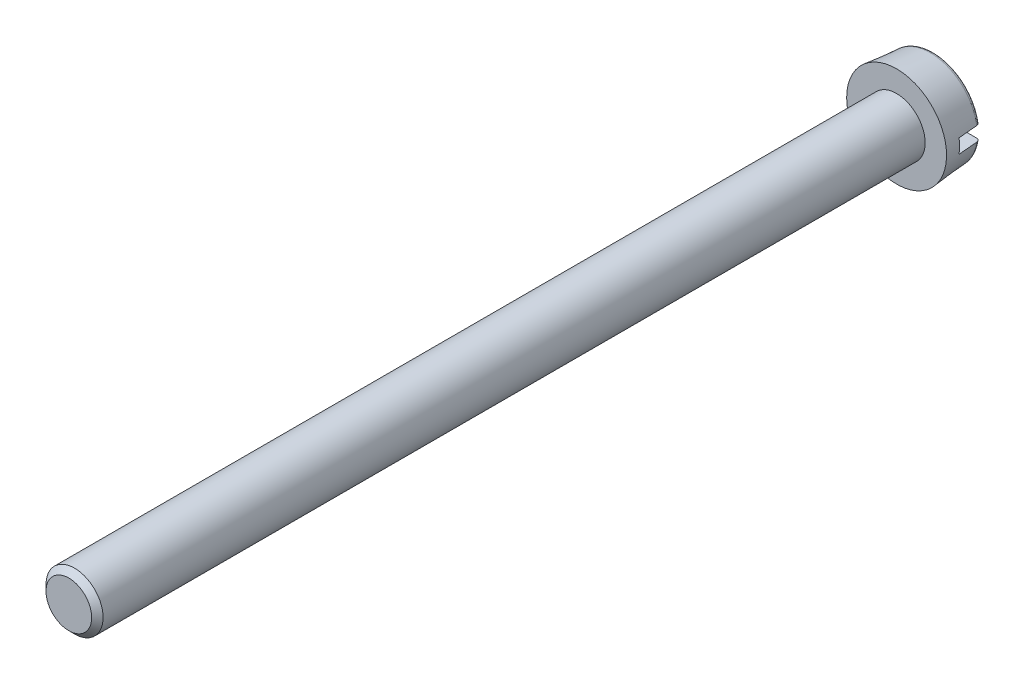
ISO-10303-21;
HEADER;
FILE_DESCRIPTION(('STEP AP214'),'2;1');
FILE_NAME('part.step','',(''),(''),'','','');
FILE_SCHEMA(('AUTOMOTIVE_DESIGN { 1 0 10303 214 1 1 1 1 }'));
ENDSEC;
DATA;
#1=APPLICATION_CONTEXT('core data for automotive mechanical design processes');
#2=APPLICATION_PROTOCOL_DEFINITION('international standard','automotive_design',2000,#1);
#3=PRODUCT_CONTEXT('',#1,'mechanical');
#4=PRODUCT('Part','Part','',(#3));
#5=PRODUCT_RELATED_PRODUCT_CATEGORY('part','',(#4));
#6=PRODUCT_DEFINITION_FORMATION('','',#4);
#7=PRODUCT_DEFINITION_CONTEXT('part definition',#1,'design');
#8=PRODUCT_DEFINITION('design','',#6,#7);
#9=PRODUCT_DEFINITION_SHAPE('','',#8);
#10=(LENGTH_UNIT() NAMED_UNIT(*) SI_UNIT(.MILLI.,.METRE.));
#11=(NAMED_UNIT(*) PLANE_ANGLE_UNIT() SI_UNIT($,.RADIAN.));
#12=(NAMED_UNIT(*) SI_UNIT($,.STERADIAN.) SOLID_ANGLE_UNIT());
#13=UNCERTAINTY_MEASURE_WITH_UNIT(LENGTH_MEASURE(1.E-05),#10,'distance_accuracy_value','');
#14=(GEOMETRIC_REPRESENTATION_CONTEXT(3) GLOBAL_UNCERTAINTY_ASSIGNED_CONTEXT((#13)) GLOBAL_UNIT_ASSIGNED_CONTEXT((#10,
#11,#12)) REPRESENTATION_CONTEXT('',''));
#15=CARTESIAN_POINT('',(0.,0.,0.));
#16=DIRECTION('',(0.,0.,1.));
#17=DIRECTION('',(1.,0.,0.));
#18=AXIS2_PLACEMENT_3D('',#15,#16,#17);
#19=CARTESIAN_POINT('',(0.,0.,-2.6));
#20=DIRECTION('',(0.,0.,1.));
#21=DIRECTION('',(1.,0.,0.));
#22=AXIS2_PLACEMENT_3D('',#19,#20,#21);
#23=PLANE('',#22);
#24=DIRECTION('',(-1.,0.,0.));
#25=VECTOR('',#24,1.);
#26=CARTESIAN_POINT('',(-3.5,0.5,-2.6));
#27=LINE('',#26,#25);
#28=CARTESIAN_POINT('',(2.99280396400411,0.5,-2.6));
#29=VERTEX_POINT('',#28);
#30=CARTESIAN_POINT('',(-2.99280396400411,0.5,-2.6));
#31=VERTEX_POINT('',#30);
#32=EDGE_CURVE('E94',#29,#31,#27,.T.);
#33=ORIENTED_EDGE('',*,*,#32,.T.);
#34=CARTESIAN_POINT('',(0.,0.,-2.6));
#35=DIRECTION('',(0.,0.,-1.));
#36=DIRECTION('',(-1.,0.,0.));
#37=AXIS2_PLACEMENT_3D('',#34,#35,#36);
#38=CIRCLE('',#37,3.03428336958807);
#39=EDGE_CURVE('E105',#31,#29,#38,.T.);
#40=ORIENTED_EDGE('',*,*,#39,.T.);
#41=EDGE_LOOP('',(#33,#40));
#42=FACE_BOUND('',#41,.T.);
#43=ADVANCED_FACE('F29',(#42),#23,.F.);
#44=DIRECTION('',(1.,0.,0.));
#45=VECTOR('',#44,1.);
#46=CARTESIAN_POINT('',(-3.5,-0.5,-2.6));
#47=LINE('',#46,#45);
#48=CARTESIAN_POINT('',(-2.99280396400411,-0.5,-2.6));
#49=VERTEX_POINT('',#48);
#50=CARTESIAN_POINT('',(2.99280396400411,-0.5,-2.6));
#51=VERTEX_POINT('',#50);
#52=EDGE_CURVE('E177',#49,#51,#47,.T.);
#53=ORIENTED_EDGE('',*,*,#52,.T.);
#54=EDGE_CURVE('E108',#51,#49,#38,.T.);
#55=ORIENTED_EDGE('',*,*,#54,.T.);
#56=EDGE_LOOP('',(#53,#55));
#57=FACE_BOUND('',#56,.T.);
#58=ADVANCED_FACE('F170',(#57),#23,.F.);
#59=CARTESIAN_POINT('',(0.,0.,-2.34));
#60=DIRECTION('',(0.,0.,-1.));
#61=DIRECTION('',(-1.,0.,0.));
#62=AXIS2_PLACEMENT_3D('',#59,#60,#61);
#63=TOROIDAL_SURFACE('',#62,3.03428336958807,0.26);
#64=CARTESIAN_POINT('',(-3.20593369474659,-0.5,-2.49273899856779));
#65=CARTESIAN_POINT('',(-3.21452220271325,-0.5,-2.48104813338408));
#66=CARTESIAN_POINT('',(-3.22213584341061,-0.5,-2.4686288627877));
#67=CARTESIAN_POINT('',(-3.23517931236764,-0.5,-2.44267992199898));
#68=CARTESIAN_POINT('',(-3.24060678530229,-0.5,-2.42914907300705));
#69=CARTESIAN_POINT('',(-3.2491065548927,-0.5,-2.40136759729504));
#70=CARTESIAN_POINT('',(-3.25217924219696,-0.5,-2.38711709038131));
#71=CARTESIAN_POINT('',(-3.25587593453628,-0.5,-2.35830538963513));
#72=CARTESIAN_POINT('',(-3.25650051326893,-0.5,-2.34374426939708));
#73=CARTESIAN_POINT('',(-3.25528642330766,-0.5,-2.31478610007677));
#74=CARTESIAN_POINT('',(-3.25345800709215,-0.5,-2.30038862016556));
#75=CARTESIAN_POINT('',(-3.24741106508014,-0.5,-2.27210454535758));
#76=CARTESIAN_POINT('',(-3.24319247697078,-0.5,-2.25821796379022));
#77=CARTESIAN_POINT('',(-3.23248845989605,-0.5,-2.23133883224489));
#78=CARTESIAN_POINT('',(-3.22600169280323,-0.5,-2.21834681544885));
#79=CARTESIAN_POINT('',(-3.21095392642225,-0.5,-2.1936258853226));
#80=CARTESIAN_POINT('',(-3.20239287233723,-0.5,-2.18189700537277));
#81=CARTESIAN_POINT('',(-3.1833771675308,-0.5,-2.1599421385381));
#82=CARTESIAN_POINT('',(-3.17290934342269,-0.5,-2.14972756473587));
#83=CARTESIAN_POINT('',(-3.15042433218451,-0.5,-2.13117694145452));
#84=CARTESIAN_POINT('',(-3.13840706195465,-0.5,-2.12284099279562));
#85=CARTESIAN_POINT('',(-3.11301845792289,-0.5,-2.10818216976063));
#86=CARTESIAN_POINT('',(-3.09963325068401,-0.5,-2.10188332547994));
#87=CARTESIAN_POINT('',(-3.07200360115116,-0.5,-2.09159292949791));
#88=CARTESIAN_POINT('',(-3.05775910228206,-0.5,-2.08760152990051));
#89=CARTESIAN_POINT('',(-3.02863847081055,-0.5,-2.08199385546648));
#90=CARTESIAN_POINT('',(-3.01375693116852,-0.5,-2.0804056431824));
#91=CARTESIAN_POINT('',(-2.98393701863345,-0.5,-2.07973102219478));
#92=CARTESIAN_POINT('',(-2.96899864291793,-0.5,-2.08064473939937));
#93=CARTESIAN_POINT('',(-2.93937852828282,-0.5,-2.08496295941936));
#94=CARTESIAN_POINT('',(-2.92469933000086,-0.5,-2.08838491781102));
#95=CARTESIAN_POINT('',(-2.89612444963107,-0.5,-2.09764767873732));
#96=CARTESIAN_POINT('',(-2.88222877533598,-0.5,-2.10348850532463));
#97=CARTESIAN_POINT('',(-2.85564093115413,-0.5,-2.11742304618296));
#98=CARTESIAN_POINT('',(-2.84294711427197,-0.5,-2.12551361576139));
#99=CARTESIAN_POINT('',(-2.81911627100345,-0.5,-2.14373207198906));
#100=CARTESIAN_POINT('',(-2.80797917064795,-0.5,-2.15385986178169));
#101=CARTESIAN_POINT('',(-2.78770744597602,-0.5,-2.175756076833));
#102=CARTESIAN_POINT('',(-2.77855308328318,-0.5,-2.18750622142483));
#103=CARTESIAN_POINT('',(-2.76238342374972,-0.5,-2.21239644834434));
#104=CARTESIAN_POINT('',(-2.75536793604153,-0.5,-2.22553640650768));
#105=CARTESIAN_POINT('',(-2.74378882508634,-0.5,-2.25261692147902));
#106=CARTESIAN_POINT('',(-2.73918923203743,-0.5,-2.26654210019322));
#107=CARTESIAN_POINT('',(-2.73242630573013,-0.5,-2.29497183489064));
#108=CARTESIAN_POINT('',(-2.7302627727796,-0.5,-2.3094763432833));
#109=CARTESIAN_POINT('',(-2.72845260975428,-0.5,-2.33846034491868));
#110=CARTESIAN_POINT('',(-2.72877510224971,-0.5,-2.35293791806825));
#111=CARTESIAN_POINT('',(-2.73185338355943,-0.5,-2.38163157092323));
#112=CARTESIAN_POINT('',(-2.73460910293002,-0.5,-2.39584765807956));
#113=CARTESIAN_POINT('',(-2.74245689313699,-0.5,-2.42357874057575));
#114=CARTESIAN_POINT('',(-2.74754285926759,-0.5,-2.43709546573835));
#115=CARTESIAN_POINT('',(-2.75989322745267,-0.5,-2.46309346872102));
#116=CARTESIAN_POINT('',(-2.76715770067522,-0.5,-2.4755747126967));
#117=CARTESIAN_POINT('',(-2.78371912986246,-0.5,-2.49926528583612));
#118=CARTESIAN_POINT('',(-2.79303287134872,-0.5,-2.51046287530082));
#119=CARTESIAN_POINT('',(-2.81338307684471,-0.5,-2.53116410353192));
#120=CARTESIAN_POINT('',(-2.82441967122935,-0.5,-2.54066761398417));
#121=CARTESIAN_POINT('',(-2.84807721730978,-0.5,-2.5578611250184));
#122=CARTESIAN_POINT('',(-2.86071925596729,-0.5,-2.56552211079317));
#123=CARTESIAN_POINT('',(-2.88709689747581,-0.5,-2.57864615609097));
#124=CARTESIAN_POINT('',(-2.90083258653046,-0.5,-2.58410904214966));
#125=CARTESIAN_POINT('',(-2.92920867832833,-0.5,-2.59275435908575));
#126=CARTESIAN_POINT('',(-2.94385884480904,-0.5,-2.59590476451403));
#127=CARTESIAN_POINT('',(-2.97347913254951,-0.5,-2.59971834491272));
#128=CARTESIAN_POINT('',(-2.98844925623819,-0.5,-2.60038150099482));
#129=CARTESIAN_POINT('',(-3.01838249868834,-0.5,-2.59919693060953));
#130=CARTESIAN_POINT('',(-3.03334500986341,-0.5,-2.5973337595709));
#131=CARTESIAN_POINT('',(-3.06274709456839,-0.5,-2.59111373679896));
#132=CARTESIAN_POINT('',(-3.0771865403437,-0.5,-2.58675628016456));
#133=CARTESIAN_POINT('',(-3.10508461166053,-0.5,-2.57567635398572));
#134=CARTESIAN_POINT('',(-3.11854561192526,-0.5,-2.56895985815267));
#135=CARTESIAN_POINT('',(-3.14412097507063,-0.5,-2.55334434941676));
#136=CARTESIAN_POINT('',(-3.15623699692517,-0.5,-2.544448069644));
#137=CARTESIAN_POINT('',(-3.17464140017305,-0.5,-2.5283401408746));
#138=CARTESIAN_POINT('',(-3.18144049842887,-0.5,-2.52170233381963));
#139=CARTESIAN_POINT('',(-3.19427675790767,-0.5,-2.50772663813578));
#140=CARTESIAN_POINT('',(-3.20031392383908,-0.5,-2.50038875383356));
#141=CARTESIAN_POINT('',(-3.20593369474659,-0.5,-2.49273899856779));
#142=B_SPLINE_CURVE_WITH_KNOTS('',3,(#64,#65,#66,#67,#68,#69,#70,#71,#72,#73,#74,#75,#76,#77,
#78,#79,#80,#81,#82,#83,#84,#85,#86,#87,#88,#89,#90,#91,#92,#93,#94,#95,#96,#97,#98,#99,#100,
#101,#102,#103,#104,#105,#106,#107,#108,#109,#110,#111,#112,#113,#114,#115,#116,#117,#118,#119,
#120,#121,#122,#123,#124,#125,#126,#127,#128,#129,#130,#131,#132,#133,#134,#135,#136,#137,#138,
#139,#140,#141),.UNSPECIFIED.,.T.,.F.,(4,2,2,2,2,2,2,2,2,2,2,2,2,2,2,2,2,2,2,2,2,2,2,2,2,2,2,2,
2,2,2,2,2,2,2,2,2,2,4),(0.,0.0434852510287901,0.0870172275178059,0.130541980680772,
0.174056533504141,0.217389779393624,0.260724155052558,0.304084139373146,0.347445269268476,
0.391118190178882,0.434793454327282,0.478966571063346,0.523142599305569,0.567830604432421,
0.612520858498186,0.657525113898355,0.702529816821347,0.74747192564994,0.792411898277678,
0.836881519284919,0.881347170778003,0.925130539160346,0.968910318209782,1.01214721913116,
1.05538288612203,1.0985059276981,1.14163037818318,1.18512216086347,1.22861723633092,
1.27275797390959,1.31690219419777,1.36164679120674,1.40639172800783,1.45141144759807,
1.4964420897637,1.54135951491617,1.58622090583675,1.61467505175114,1.64312902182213),.UNSPECIFIED.);
#143=CARTESIAN_POINT('',(-3.25511678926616,-0.5,-2.3626604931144));
#144=VERTEX_POINT('',#143);
#145=EDGE_CURVE('E51',#49,#144,#142,.T.);
#146=ORIENTED_EDGE('',*,*,#145,.F.);
#147=ORIENTED_EDGE('',*,*,#54,.F.);
#148=CARTESIAN_POINT('',(2.77362660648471,-0.5,-2.48479543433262));
#149=CARTESIAN_POINT('',(2.76548434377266,-0.5,-2.47284351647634));
#150=CARTESIAN_POINT('',(2.75833631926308,-0.5,-2.46020266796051));
#151=CARTESIAN_POINT('',(2.74625336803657,-0.5,-2.4338924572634));
#152=CARTESIAN_POINT('',(2.74132071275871,-0.5,-2.42022205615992));
#153=CARTESIAN_POINT('',(2.73382888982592,-0.5,-2.3922442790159));
#154=CARTESIAN_POINT('',(2.73126965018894,-0.5,-2.37793692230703));
#155=CARTESIAN_POINT('',(2.72860695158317,-0.5,-2.34909883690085));
#156=CARTESIAN_POINT('',(2.72850291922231,-0.5,-2.33456816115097));
#157=CARTESIAN_POINT('',(2.73074543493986,-0.5,-2.30578417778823));
#158=CARTESIAN_POINT('',(2.73307747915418,-0.5,-2.29152973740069));
#159=CARTESIAN_POINT('',(2.74009676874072,-0.5,-2.26361314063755));
#160=CARTESIAN_POINT('',(2.74478408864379,-0.5,-2.24995100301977));
#161=CARTESIAN_POINT('',(2.75638249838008,-0.5,-2.2235704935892));
#162=CARTESIAN_POINT('',(2.76329847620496,-0.5,-2.21085427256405));
#163=CARTESIAN_POINT('',(2.77914304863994,-0.5,-2.18674511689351));
#164=CARTESIAN_POINT('',(2.78807174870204,-0.5,-2.17535225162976));
#165=CARTESIAN_POINT('',(2.80779938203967,-0.5,-2.15406460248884));
#166=CARTESIAN_POINT('',(2.81861943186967,-0.5,-2.14418939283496));
#167=CARTESIAN_POINT('',(2.84174230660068,-0.5,-2.12636266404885));
#168=CARTESIAN_POINT('',(2.8540452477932,-0.5,-2.11841129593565));
#169=CARTESIAN_POINT('',(2.87998625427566,-0.5,-2.10453163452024));
#170=CARTESIAN_POINT('',(2.89364181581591,-0.5,-2.09863603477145));
#171=CARTESIAN_POINT('',(2.92174199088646,-0.5,-2.08919230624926));
#172=CARTESIAN_POINT('',(2.93618665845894,-0.5,-2.0856443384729));
#173=CARTESIAN_POINT('',(2.96562688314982,-0.5,-2.08096320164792));
#174=CARTESIAN_POINT('',(2.98062677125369,-0.5,-2.07985722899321));
#175=CARTESIAN_POINT('',(3.01060035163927,-0.5,-2.08017230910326));
#176=CARTESIAN_POINT('',(3.02557404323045,-0.5,-2.08159342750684));
#177=CARTESIAN_POINT('',(3.05510647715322,-0.5,-2.0869352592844));
#178=CARTESIAN_POINT('',(3.06966413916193,-0.5,-2.09086195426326));
#179=CARTESIAN_POINT('',(3.09790702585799,-0.5,-2.10111896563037));
#180=CARTESIAN_POINT('',(3.1115922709,-0.5,-2.10744922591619));
#181=CARTESIAN_POINT('',(3.13760610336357,-0.5,-2.12229619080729));
#182=CARTESIAN_POINT('',(3.14994271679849,-0.5,-2.13079882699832));
#183=CARTESIAN_POINT('',(3.17299205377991,-0.5,-2.14977690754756));
#184=CARTESIAN_POINT('',(3.18370487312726,-0.5,-2.16025223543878));
#185=CARTESIAN_POINT('',(3.2030703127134,-0.5,-2.18275038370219));
#186=CARTESIAN_POINT('',(3.21174515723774,-0.5,-2.19475407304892));
#187=CARTESIAN_POINT('',(3.22692841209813,-0.5,-2.22006136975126));
#188=CARTESIAN_POINT('',(3.23343696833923,-0.5,-2.23336488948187));
#189=CARTESIAN_POINT('',(3.24402537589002,-0.5,-2.26072709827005));
#190=CARTESIAN_POINT('',(3.24813264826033,-0.5,-2.27477517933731));
#191=CARTESIAN_POINT('',(3.25391041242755,-0.5,-2.30336369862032));
#192=CARTESIAN_POINT('',(3.2555810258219,-0.5,-2.31790411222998));
#193=CARTESIAN_POINT('',(3.25643125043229,-0.5,-2.34694784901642));
#194=CARTESIAN_POINT('',(3.25562947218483,-0.5,-2.36145063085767));
#195=CARTESIAN_POINT('',(3.25159984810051,-0.5,-2.39011483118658));
#196=CARTESIAN_POINT('',(3.24837204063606,-0.5,-2.40427625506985));
#197=CARTESIAN_POINT('',(3.23959162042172,-0.5,-2.43184461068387));
#198=CARTESIAN_POINT('',(3.2340410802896,-0.5,-2.44525220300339));
#199=CARTESIAN_POINT('',(3.22078064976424,-0.5,-2.47095278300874));
#200=CARTESIAN_POINT('',(3.21307071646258,-0.5,-2.48324574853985));
#201=CARTESIAN_POINT('',(3.19566551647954,-0.5,-2.50644928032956));
#202=CARTESIAN_POINT('',(3.18595873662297,-0.5,-2.51735120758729));
#203=CARTESIAN_POINT('',(3.1648702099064,-0.5,-2.53739204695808));
#204=CARTESIAN_POINT('',(3.15348837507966,-0.5,-2.54653086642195));
#205=CARTESIAN_POINT('',(3.12924254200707,-0.5,-2.56289277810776));
#206=CARTESIAN_POINT('',(3.1163638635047,-0.5,-2.57009411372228));
#207=CARTESIAN_POINT('',(3.08959088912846,-0.5,-2.58226175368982));
#208=CARTESIAN_POINT('',(3.07569652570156,-0.5,-2.58722790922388));
#209=CARTESIAN_POINT('',(3.04710871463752,-0.5,-2.5948446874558));
#210=CARTESIAN_POINT('',(3.03240769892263,-0.5,-2.59746691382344));
#211=CARTESIAN_POINT('',(3.00277466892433,-0.5,-2.60022853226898));
#212=CARTESIAN_POINT('',(2.98784265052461,-0.5,-2.60036788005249));
#213=CARTESIAN_POINT('',(2.95804002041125,-0.5,-2.5981541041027));
#214=CARTESIAN_POINT('',(2.9431709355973,-0.5,-2.59578037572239));
#215=CARTESIAN_POINT('',(2.91403721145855,-0.5,-2.58857139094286));
#216=CARTESIAN_POINT('',(2.89977273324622,-0.5,-2.58373548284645));
#217=CARTESIAN_POINT('',(2.87224730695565,-0.5,-2.57172586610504));
#218=CARTESIAN_POINT('',(2.85898742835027,-0.5,-2.56454970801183));
#219=CARTESIAN_POINT('',(2.83388686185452,-0.5,-2.54805876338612));
#220=CARTESIAN_POINT('',(2.82204445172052,-0.5,-2.53874661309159));
#221=CARTESIAN_POINT('',(2.80406578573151,-0.5,-2.5219325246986));
#222=CARTESIAN_POINT('',(2.79740698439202,-0.5,-2.51498036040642));
#223=CARTESIAN_POINT('',(2.78489446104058,-0.5,-2.50038547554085));
#224=CARTESIAN_POINT('',(2.77904073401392,-0.5,-2.49274275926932));
#225=CARTESIAN_POINT('',(2.77362660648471,-0.5,-2.48479543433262));
#226=B_SPLINE_CURVE_WITH_KNOTS('',3,(#148,#149,#150,#151,#152,#153,#154,#155,#156,#157,#158,
#159,#160,#161,#162,#163,#164,#165,#166,#167,#168,#169,#170,#171,#172,#173,#174,#175,#176,#177,
#178,#179,#180,#181,#182,#183,#184,#185,#186,#187,#188,#189,#190,#191,#192,#193,#194,#195,#196,
#197,#198,#199,#200,#201,#202,#203,#204,#205,#206,#207,#208,#209,#210,#211,#212,#213,#214,#215,
#216,#217,#218,#219,#220,#221,#222,#223,#224,#225),.UNSPECIFIED.,.T.,.F.,(4,2,2,2,2,2,2,2,2,2,2,
2,2,2,2,2,2,2,2,2,2,2,2,2,2,2,2,2,2,2,2,2,2,2,2,2,2,2,4),(0.,0.0433509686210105,
0.086746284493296,0.130140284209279,0.173524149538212,0.216651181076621,0.259779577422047,
0.303003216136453,0.346229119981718,0.389972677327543,0.433719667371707,0.478133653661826,
0.522550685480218,0.567459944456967,0.612370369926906,0.657388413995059,0.702405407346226,
0.747137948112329,0.791867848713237,0.836084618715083,0.880298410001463,0.923996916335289,
0.967693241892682,1.01106145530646,1.05442898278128,1.09775789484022,1.14108766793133,
1.18467464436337,1.22826391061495,1.27232395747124,1.3163869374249,1.36097676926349,
1.40556739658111,1.45052647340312,1.49549745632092,1.5405156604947,1.58547859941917,
1.61430463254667,1.64313048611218),.UNSPECIFIED.);
#227=CARTESIAN_POINT('',(3.25511678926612,-0.5,-2.36266049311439));
#228=VERTEX_POINT('',#227);
#229=EDGE_CURVE('E125',#228,#51,#226,.T.);
#230=ORIENTED_EDGE('',*,*,#229,.F.);
#231=CARTESIAN_POINT('',(0.,0.,-2.36266049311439));
#232=DIRECTION('',(0.,0.,-1.));
#233=DIRECTION('',(-1.,0.,0.));
#234=AXIS2_PLACEMENT_3D('',#231,#232,#233);
#235=CIRCLE('',#234,3.29329399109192);
#236=EDGE_CURVE('E117',#228,#144,#235,.T.);
#237=ORIENTED_EDGE('',*,*,#236,.T.);
#238=EDGE_LOOP('',(#146,#147,#230,#237));
#239=FACE_BOUND('',#238,.T.);
#240=ADVANCED_FACE('F129',(#239),#63,.T.);
#241=CARTESIAN_POINT('',(-3.20593369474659,0.5,-2.49273899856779));
#242=CARTESIAN_POINT('',(-3.19720688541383,0.5,-2.50461588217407));
#243=CARTESIAN_POINT('',(-3.18746088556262,0.5,-2.51575822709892));
#244=CARTESIAN_POINT('',(-3.16622271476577,0.5,-2.53625162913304));
#245=CARTESIAN_POINT('',(-3.15472821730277,0.5,-2.54560026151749));
#246=CARTESIAN_POINT('',(-3.1303476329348,0.5,-2.56223273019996));
#247=CARTESIAN_POINT('',(-3.11746294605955,0.5,-2.56951861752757));
#248=CARTESIAN_POINT('',(-3.09066557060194,0.5,-2.58184341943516));
#249=CARTESIAN_POINT('',(-3.07675313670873,0.5,-2.58688288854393));
#250=CARTESIAN_POINT('',(-3.04815896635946,0.5,-2.59462446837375));
#251=CARTESIAN_POINT('',(-3.03347146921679,0.5,-2.5973053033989));
#252=CARTESIAN_POINT('',(-3.00385434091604,0.5,-2.60018603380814));
#253=CARTESIAN_POINT('',(-2.98892468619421,0.5,-2.60038568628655));
#254=CARTESIAN_POINT('',(-2.95911402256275,0.5,-2.59829256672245));
#255=CARTESIAN_POINT('',(-2.94423448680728,0.5,-2.59597875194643));
#256=CARTESIAN_POINT('',(-2.91507381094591,0.5,-2.58888818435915));
#257=CARTESIAN_POINT('',(-2.90079268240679,0.5,-2.58411138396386));
#258=CARTESIAN_POINT('',(-2.87322792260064,0.5,-2.57221805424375));
#259=CARTESIAN_POINT('',(-2.85994498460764,0.5,-2.5650999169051));
#260=CARTESIAN_POINT('',(-2.8347762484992,0.5,-2.54871630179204));
#261=CARTESIAN_POINT('',(-2.82289039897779,0.5,-2.53945090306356));
#262=CARTESIAN_POINT('',(-2.80096835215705,0.5,-2.51911588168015));
#263=CARTESIAN_POINT('',(-2.79091707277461,0.5,-2.5080625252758));
#264=CARTESIAN_POINT('',(-2.77284652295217,0.5,-2.4844033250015));
#265=CARTESIAN_POINT('',(-2.76482708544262,0.5,-2.4717976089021));
#266=CARTESIAN_POINT('',(-2.75117573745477,0.5,-2.44559185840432));
#267=CARTESIAN_POINT('',(-2.74551011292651,0.5,-2.4320093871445));
#268=CARTESIAN_POINT('',(-2.73657585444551,0.5,-2.40407781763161));
#269=CARTESIAN_POINT('',(-2.73330700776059,0.5,-2.38972878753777));
#270=CARTESIAN_POINT('',(-2.72929919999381,0.5,-2.36088361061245));
#271=CARTESIAN_POINT('',(-2.72852602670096,0.5,-2.34639220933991));
#272=CARTESIAN_POINT('',(-2.72943755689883,0.5,-2.31748731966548));
#273=CARTESIAN_POINT('',(-2.73112215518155,0.5,-2.30307382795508));
#274=CARTESIAN_POINT('',(-2.73688073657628,0.5,-2.2748102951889));
#275=CARTESIAN_POINT('',(-2.74094240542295,0.5,-2.26095774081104));
#276=CARTESIAN_POINT('',(-2.75131958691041,0.5,-2.2341248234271));
#277=CARTESIAN_POINT('',(-2.75763514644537,0.5,-2.22114447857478));
#278=CARTESIAN_POINT('',(-2.77237589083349,0.5,-2.19633280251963));
#279=CARTESIAN_POINT('',(-2.78081407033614,0.5,-2.18450919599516));
#280=CARTESIAN_POINT('',(-2.79953010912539,0.5,-2.16242134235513));
#281=CARTESIAN_POINT('',(-2.80980809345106,0.5,-2.15215720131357));
#282=CARTESIAN_POINT('',(-2.83206536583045,0.5,-2.13332447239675));
#283=CARTESIAN_POINT('',(-2.84406655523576,0.5,-2.12478177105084));
#284=CARTESIAN_POINT('',(-2.8693161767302,0.5,-2.10979839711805));
#285=CARTESIAN_POINT('',(-2.88256470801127,0.5,-2.10335789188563));
#286=CARTESIAN_POINT('',(-2.9101397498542,0.5,-2.092667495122));
#287=CARTESIAN_POINT('',(-2.92447910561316,0.5,-2.08845072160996));
#288=CARTESIAN_POINT('',(-2.95365982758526,0.5,-2.0824622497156));
#289=CARTESIAN_POINT('',(-2.968501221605,0.5,-2.08069068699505));
#290=CARTESIAN_POINT('',(-2.99839471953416,0.5,-2.07963690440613));
#291=CARTESIAN_POINT('',(-3.01344755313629,0.5,-2.08037523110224));
#292=CARTESIAN_POINT('',(-3.04321554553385,0.5,-2.0843707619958));
#293=CARTESIAN_POINT('',(-3.05793070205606,0.5,-2.08762798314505));
#294=CARTESIAN_POINT('',(-3.08658686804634,0.5,-2.09657351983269));
#295=CARTESIAN_POINT('',(-3.10052864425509,0.5,-2.10225937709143));
#296=CARTESIAN_POINT('',(-3.12724780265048,0.5,-2.11591107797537));
#297=CARTESIAN_POINT('',(-3.14002522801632,0.5,-2.1238768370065));
#298=CARTESIAN_POINT('',(-3.16393077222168,0.5,-2.14179117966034));
#299=CARTESIAN_POINT('',(-3.17507232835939,0.5,-2.15172182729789));
#300=CARTESIAN_POINT('',(-3.19550476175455,0.5,-2.17333326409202));
#301=CARTESIAN_POINT('',(-3.20479575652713,0.5,-2.18501394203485));
#302=CARTESIAN_POINT('',(-3.22114384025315,0.5,-2.20964215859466));
#303=CARTESIAN_POINT('',(-3.2282265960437,0.5,-2.2225726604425));
#304=CARTESIAN_POINT('',(-3.24009365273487,0.5,-2.24944798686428));
#305=CARTESIAN_POINT('',(-3.24487819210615,0.5,-2.26339270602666));
#306=CARTESIAN_POINT('',(-3.25196408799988,0.5,-2.29174085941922));
#307=CARTESIAN_POINT('',(-3.25429139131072,0.5,-2.30613781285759));
#308=CARTESIAN_POINT('',(-3.25648210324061,0.5,-2.33512183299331));
#309=CARTESIAN_POINT('',(-3.25634497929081,0.5,-2.34970894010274));
#310=CARTESIAN_POINT('',(-3.2536172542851,0.5,-2.37857966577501));
#311=CARTESIAN_POINT('',(-3.25103837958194,0.5,-2.39286440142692));
#312=CARTESIAN_POINT('',(-3.24352292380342,0.5,-2.42078632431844));
#313=CARTESIAN_POINT('',(-3.23858925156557,0.5,-2.43442428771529));
#314=CARTESIAN_POINT('',(-3.2288992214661,0.5,-2.45550463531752));
#315=CARTESIAN_POINT('',(-3.22483666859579,0.5,-2.46327369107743));
#316=CARTESIAN_POINT('',(-3.21594731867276,0.5,-2.47836132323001));
#317=CARTESIAN_POINT('',(-3.21112052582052,0.5,-2.48567990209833));
#318=CARTESIAN_POINT('',(-3.20593369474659,0.5,-2.49273899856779));
#319=B_SPLINE_CURVE_WITH_KNOTS('',3,(#241,#242,#243,#244,#245,#246,#247,#248,#249,#250,#251,
#252,#253,#254,#255,#256,#257,#258,#259,#260,#261,#262,#263,#264,#265,#266,#267,#268,#269,#270,
#271,#272,#273,#274,#275,#276,#277,#278,#279,#280,#281,#282,#283,#284,#285,#286,#287,#288,#289,
#290,#291,#292,#293,#294,#295,#296,#297,#298,#299,#300,#301,#302,#303,#304,#305,#306,#307,#308,
#309,#310,#311,#312,#313,#314,#315,#316,#317,#318),.UNSPECIFIED.,.T.,.F.,(4,2,2,2,2,2,2,2,2,2,2,
2,2,2,2,2,2,2,2,2,2,2,2,2,2,2,2,2,2,2,2,2,2,2,2,2,2,2,4),(0.,0.0441824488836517,
0.088424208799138,0.132621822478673,0.17680851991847,0.221389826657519,0.265975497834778,
0.310937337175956,0.355900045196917,0.400893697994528,0.445885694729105,0.490489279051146,
0.535089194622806,0.579026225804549,0.622959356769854,0.666287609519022,0.709614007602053,
0.752717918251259,0.795822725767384,0.839198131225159,0.882576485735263,0.926565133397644,
0.970557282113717,1.01518731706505,1.05981982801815,1.10481858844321,1.14981765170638,
1.19477127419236,1.23972322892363,1.28428235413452,1.3288386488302,1.37285588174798,
1.41686854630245,1.4604116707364,1.50396420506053,1.54730863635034,1.59059966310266,
1.61685990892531,1.64312001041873),.UNSPECIFIED.);
#320=CARTESIAN_POINT('',(-3.25511678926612,0.5,-2.36266049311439));
#321=VERTEX_POINT('',#320);
#322=EDGE_CURVE('E180',#321,#31,#319,.T.);
#323=ORIENTED_EDGE('',*,*,#322,.F.);
#324=CARTESIAN_POINT('',(3.25511678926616,0.5,-2.3626604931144));
#325=VERTEX_POINT('',#324);
#326=EDGE_CURVE('E113',#321,#325,#235,.T.);
#327=ORIENTED_EDGE('',*,*,#326,.T.);
#328=CARTESIAN_POINT('',(2.77362660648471,0.5,-2.48479543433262));
#329=CARTESIAN_POINT('',(2.781944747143,0.5,-2.49700317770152));
#330=CARTESIAN_POINT('',(2.79131264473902,0.5,-2.50850990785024));
#331=CARTESIAN_POINT('',(2.81186186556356,0.5,-2.52979041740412));
#332=CARTESIAN_POINT('',(2.82304569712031,0.5,-2.5395617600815));
#333=CARTESIAN_POINT('',(2.84687786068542,0.5,-2.55708642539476));
#334=CARTESIAN_POINT('',(2.85952457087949,0.5,-2.56484195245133));
#335=CARTESIAN_POINT('',(2.88592611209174,0.5,-2.57814205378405));
#336=CARTESIAN_POINT('',(2.89968065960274,0.5,-2.58368719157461));
#337=CARTESIAN_POINT('',(2.92806082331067,0.5,-2.59247078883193));
#338=CARTESIAN_POINT('',(2.94269385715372,0.5,-2.59568529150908));
#339=CARTESIAN_POINT('',(2.97229203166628,0.5,-2.59962968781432));
#340=CARTESIAN_POINT('',(2.98725720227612,0.5,-2.60035935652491));
#341=CARTESIAN_POINT('',(3.01719519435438,0.5,-2.59930833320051));
#342=CARTESIAN_POINT('',(3.03216745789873,0.5,-2.59751162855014));
#343=CARTESIAN_POINT('',(3.06159617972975,0.5,-2.59142303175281));
#344=CARTESIAN_POINT('',(3.07605264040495,0.5,-2.58713115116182));
#345=CARTESIAN_POINT('',(3.10399181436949,0.5,-2.57617986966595));
#346=CARTESIAN_POINT('',(3.11747720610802,0.5,-2.56952730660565));
#347=CARTESIAN_POINT('',(3.14312449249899,0.5,-2.55403097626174));
#348=CARTESIAN_POINT('',(3.15528645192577,0.5,-2.5451873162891));
#349=CARTESIAN_POINT('',(3.17781124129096,0.5,-2.52565065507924));
#350=CARTESIAN_POINT('',(3.1881906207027,0.5,-2.51497673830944));
#351=CARTESIAN_POINT('',(3.20698316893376,0.5,-2.49201908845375));
#352=CARTESIAN_POINT('',(3.21539646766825,0.5,-2.47973546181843));
#353=CARTESIAN_POINT('',(3.22991013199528,0.5,-2.45406808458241));
#354=CARTESIAN_POINT('',(3.23603742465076,0.5,-2.44069955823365));
#355=CARTESIAN_POINT('',(3.24593552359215,0.5,-2.41311689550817));
#356=CARTESIAN_POINT('',(3.24970647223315,0.5,-2.3989028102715));
#357=CARTESIAN_POINT('',(3.2547513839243,0.5,-2.37018078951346));
#358=CARTESIAN_POINT('',(3.25604921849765,0.5,-2.35567704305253));
#359=CARTESIAN_POINT('',(3.25618101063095,0.5,-2.32665859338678));
#360=CARTESIAN_POINT('',(3.25501504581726,0.5,-2.31214389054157));
#361=CARTESIAN_POINT('',(3.25026412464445,0.5,-2.28357417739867));
#362=CARTESIAN_POINT('',(3.24668854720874,0.5,-2.26951760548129));
#363=CARTESIAN_POINT('',(3.23723540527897,0.5,-2.24220149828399));
#364=CARTESIAN_POINT('',(3.23135782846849,0.5,-2.22894196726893));
#365=CARTESIAN_POINT('',(3.21745308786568,0.5,-2.20354862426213));
#366=CARTESIAN_POINT('',(3.20941921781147,0.5,-2.1914184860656));
#367=CARTESIAN_POINT('',(3.19144614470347,0.5,-2.16866365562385));
#368=CARTESIAN_POINT('',(3.18150686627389,0.5,-2.15803902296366));
#369=CARTESIAN_POINT('',(3.15991078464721,0.5,-2.13849113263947));
#370=CARTESIAN_POINT('',(3.14823918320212,0.5,-2.12958422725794));
#371=CARTESIAN_POINT('',(3.12358097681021,0.5,-2.11382899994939));
#372=CARTESIAN_POINT('',(3.11059429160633,0.5,-2.10698080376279));
#373=CARTESIAN_POINT('',(3.08350799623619,0.5,-2.09545056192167));
#374=CARTESIAN_POINT('',(3.0693969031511,0.5,-2.0907954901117));
#375=CARTESIAN_POINT('',(3.04059764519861,0.5,-2.08389295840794));
#376=CARTESIAN_POINT('',(3.02590944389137,0.5,-2.08164565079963));
#377=CARTESIAN_POINT('',(2.9962085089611,0.5,-2.07960294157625));
#378=CARTESIAN_POINT('',(2.98119398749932,0.5,-2.07983347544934));
#379=CARTESIAN_POINT('',(2.95141420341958,0.5,-2.08280015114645));
#380=CARTESIAN_POINT('',(2.93664895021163,0.5,-2.08553638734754));
#381=CARTESIAN_POINT('',(2.90772187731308,0.5,-2.09345815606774));
#382=CARTESIAN_POINT('',(2.89356292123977,0.5,-2.09865415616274));
#383=CARTESIAN_POINT('',(2.86632394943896,0.5,-2.1113605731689));
#384=CARTESIAN_POINT('',(2.85324392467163,0.5,-2.1188709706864));
#385=CARTESIAN_POINT('',(2.82860759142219,0.5,-2.13596138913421));
#386=CARTESIAN_POINT('',(2.8170441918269,0.5,-2.14553118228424));
#387=CARTESIAN_POINT('',(2.7957142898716,0.5,-2.16649940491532));
#388=CARTESIAN_POINT('',(2.78594767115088,0.5,-2.17789771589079));
#389=CARTESIAN_POINT('',(2.76862730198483,0.5,-2.202043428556));
#390=CARTESIAN_POINT('',(2.76104650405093,0.5,-2.21477142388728));
#391=CARTESIAN_POINT('',(2.7481681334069,0.5,-2.24133387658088));
#392=CARTESIAN_POINT('',(2.74287025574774,0.5,-2.25516818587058));
#393=CARTESIAN_POINT('',(2.73478974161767,0.5,-2.28332247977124));
#394=CARTESIAN_POINT('',(2.73196973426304,0.5,-2.29763174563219));
#395=CARTESIAN_POINT('',(2.72879700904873,0.5,-2.32652503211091));
#396=CARTESIAN_POINT('',(2.72844476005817,0.5,-2.34110910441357));
#397=CARTESIAN_POINT('',(2.73021123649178,0.5,-2.36999395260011));
#398=CARTESIAN_POINT('',(2.7323079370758,0.5,-2.38429609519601));
#399=CARTESIAN_POINT('',(2.73886954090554,0.5,-2.41233320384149));
#400=CARTESIAN_POINT('',(2.74333150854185,0.5,-2.42606885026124));
#401=CARTESIAN_POINT('',(2.75224895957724,0.5,-2.44729543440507));
#402=CARTESIAN_POINT('',(2.75599683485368,0.5,-2.45509148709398));
#403=CARTESIAN_POINT('',(2.76425222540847,0.5,-2.47027016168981));
#404=CARTESIAN_POINT('',(2.7687597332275,0.5,-2.47765278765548));
#405=CARTESIAN_POINT('',(2.77362660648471,0.5,-2.48479543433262));
#406=B_SPLINE_CURVE_WITH_KNOTS('',3,(#328,#329,#330,#331,#332,#333,#334,#335,#336,#337,#338,
#339,#340,#341,#342,#343,#344,#345,#346,#347,#348,#349,#350,#351,#352,#353,#354,#355,#356,#357,
#358,#359,#360,#361,#362,#363,#364,#365,#366,#367,#368,#369,#370,#371,#372,#373,#374,#375,#376,
#377,#378,#379,#380,#381,#382,#383,#384,#385,#386,#387,#388,#389,#390,#391,#392,#393,#394,#395,
#396,#397,#398,#399,#400,#401,#402,#403,#404,#405),.UNSPECIFIED.,.T.,.F.,(4,2,2,2,2,2,2,2,2,2,2,
2,2,2,2,2,2,2,2,2,2,2,2,2,2,2,2,2,2,2,2,2,2,2,2,2,2,2,4),(0.,0.044284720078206,
0.0886311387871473,0.132928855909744,0.177215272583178,0.221950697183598,0.266690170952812,
0.311714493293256,0.356738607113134,0.401633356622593,0.446525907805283,0.490976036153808,
0.535423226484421,0.579328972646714,0.623232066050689,0.666709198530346,0.710184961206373,
0.753492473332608,0.796800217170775,0.840244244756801,0.883689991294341,0.927530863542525,
0.971374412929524,1.01574397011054,1.06011633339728,1.10495358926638,1.14979253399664,
1.19482403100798,1.23985515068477,1.28466758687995,1.32947711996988,1.37370571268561,
1.4179283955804,1.46147206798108,1.50502401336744,1.54818726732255,1.59129707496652,
1.61720794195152,1.64311855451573),.UNSPECIFIED.);
#407=EDGE_CURVE('E181',#29,#325,#406,.T.);
#408=ORIENTED_EDGE('',*,*,#407,.F.);
#409=ORIENTED_EDGE('',*,*,#39,.F.);
#410=EDGE_LOOP('',(#323,#327,#408,#409));
#411=FACE_BOUND('',#410,.T.);
#412=ADVANCED_FACE('F155',(#411),#63,.T.);
#413=CARTESIAN_POINT('',(0.,0.,0.));
#414=DIRECTION('',(0.,0.,1.));
#415=DIRECTION('',(1.,0.,0.));
#416=AXIS2_PLACEMENT_3D('',#413,#414,#415);
#417=CONICAL_SURFACE('',#416,3.5,0.0872664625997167);
#418=CARTESIAN_POINT('',(0.,0.,0.));
#419=DIRECTION('',(0.,0.,-1.));
#420=DIRECTION('',(-1.,0.,0.));
#421=AXIS2_PLACEMENT_3D('',#418,#419,#420);
#422=CIRCLE('',#421,3.5);
#423=CARTESIAN_POINT('',(-3.5,0.,0.));
#424=VERTEX_POINT('',#423);
#425=EDGE_CURVE('E118',#424,#424,#422,.T.);
#426=ORIENTED_EDGE('',*,*,#425,.T.);
#427=EDGE_LOOP('',(#426));
#428=FACE_BOUND('',#427,.T.);
#429=CARTESIAN_POINT('',(-3.85195027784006,0.5,4.3921783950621));
#430=CARTESIAN_POINT('',(-3.76174768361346,0.5,3.36975075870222));
#431=CARTESIAN_POINT('',(-3.67149561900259,0.5,2.34732748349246));
#432=CARTESIAN_POINT('',(-3.4908610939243,0.5,0.302492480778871));
#433=CARTESIAN_POINT('',(-3.40047863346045,0.5,-0.719919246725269));
#434=CARTESIAN_POINT('',(-3.21955185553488,0.5,-2.76472839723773));
#435=CARTESIAN_POINT('',(-3.12900753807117,0.5,-3.78712582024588));
#436=CARTESIAN_POINT('',(-2.9477049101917,0.5,-5.83190171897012));
#437=CARTESIAN_POINT('',(-2.85694659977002,0.5,-6.8542801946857));
#438=CARTESIAN_POINT('',(-2.76605522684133,0.5,-7.87664685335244));
#439=B_SPLINE_CURVE_WITH_KNOTS('',3,(#429,#430,#431,#432,#433,#434,#435,#436,#437,#438),
.UNSPECIFIED.,.F.,.F.,(4,2,2,2,4),(0.,3.07919681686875,6.1583935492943,9.23759031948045,
12.3167871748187),.UNSPECIFIED.);
#440=CARTESIAN_POINT('',(-3.37568268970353,0.5,-1.));
#441=VERTEX_POINT('',#440);
#442=EDGE_CURVE('E88',#441,#321,#439,.T.);
#443=ORIENTED_EDGE('',*,*,#442,.F.);
#444=CARTESIAN_POINT('',(0.,0.,-1.));
#445=DIRECTION('',(0.,0.,1.));
#446=DIRECTION('',(1.,0.,0.));
#447=AXIS2_PLACEMENT_3D('',#444,#445,#446);
#448=CIRCLE('',#447,3.41251133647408);
#449=CARTESIAN_POINT('',(-3.37568268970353,-0.5,-1.));
#450=VERTEX_POINT('',#449);
#451=EDGE_CURVE('E89',#441,#450,#448,.T.);
#452=ORIENTED_EDGE('',*,*,#451,.T.);
#453=CARTESIAN_POINT('',(-2.76605522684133,-0.5,-7.87664685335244));
#454=CARTESIAN_POINT('',(-2.91868476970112,-0.5,-6.15972546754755));
#455=CARTESIAN_POINT('',(-3.07095610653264,-0.5,-4.4427723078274));
#456=CARTESIAN_POINT('',(-3.25199436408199,-0.5,-2.39797299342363));
#457=CARTESIAN_POINT('',(-3.28100914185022,-0.5,-2.07014878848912));
#458=CARTESIAN_POINT('',(-3.49094090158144,-0.5,0.302485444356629));
#459=CARTESIAN_POINT('',(-3.67152906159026,-0.5,2.34732457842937));
#460=CARTESIAN_POINT('',(-3.85195027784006,-0.5,4.3921783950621));
#461=B_SPLINE_CURVE_WITH_KNOTS('',3,(#453,#454,#455,#456,#457,#458,#459,#460),.UNSPECIFIED.,.F.,
.F.,(4,2,2,4),(0.,5.17107648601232,6.15839360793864,12.3167871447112),.UNSPECIFIED.);
#462=EDGE_CURVE('E79',#144,#450,#461,.T.);
#463=ORIENTED_EDGE('',*,*,#462,.F.);
#464=ORIENTED_EDGE('',*,*,#236,.F.);
#465=CARTESIAN_POINT('',(3.85195027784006,-0.5,4.3921783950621));
#466=CARTESIAN_POINT('',(3.76174768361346,-0.5,3.36975075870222));
#467=CARTESIAN_POINT('',(3.67149561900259,-0.5,2.34732748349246));
#468=CARTESIAN_POINT('',(3.4908610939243,-0.5,0.302492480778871));
#469=CARTESIAN_POINT('',(3.40047863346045,-0.5,-0.719919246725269));
#470=CARTESIAN_POINT('',(3.21955185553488,-0.5,-2.76472839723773));
#471=CARTESIAN_POINT('',(3.12900753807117,-0.5,-3.78712582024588));
#472=CARTESIAN_POINT('',(2.9477049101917,-0.5,-5.83190171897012));
#473=CARTESIAN_POINT('',(2.85694659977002,-0.5,-6.8542801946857));
#474=CARTESIAN_POINT('',(2.76605522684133,-0.5,-7.87664685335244));
#475=B_SPLINE_CURVE_WITH_KNOTS('',3,(#465,#466,#467,#468,#469,#470,#471,#472,#473,#474),
.UNSPECIFIED.,.F.,.F.,(4,2,2,2,4),(0.,3.07919681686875,6.1583935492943,9.23759031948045,
12.3167871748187),.UNSPECIFIED.);
#476=CARTESIAN_POINT('',(3.37568268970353,-0.5,-1.));
#477=VERTEX_POINT('',#476);
#478=EDGE_CURVE('E99',#477,#228,#475,.T.);
#479=ORIENTED_EDGE('',*,*,#478,.F.);
#480=CARTESIAN_POINT('',(3.37568268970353,0.5,-1.));
#481=VERTEX_POINT('',#480);
#482=EDGE_CURVE('E93',#477,#481,#448,.T.);
#483=ORIENTED_EDGE('',*,*,#482,.T.);
#484=CARTESIAN_POINT('',(2.76605522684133,0.5,-7.87664685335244));
#485=CARTESIAN_POINT('',(2.91868476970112,0.5,-6.15972546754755));
#486=CARTESIAN_POINT('',(3.07095610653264,0.5,-4.4427723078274));
#487=CARTESIAN_POINT('',(3.25199436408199,0.5,-2.39797299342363));
#488=CARTESIAN_POINT('',(3.28100914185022,0.5,-2.07014878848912));
#489=CARTESIAN_POINT('',(3.49094090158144,0.5,0.302485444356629));
#490=CARTESIAN_POINT('',(3.67152906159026,0.5,2.34732457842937));
#491=CARTESIAN_POINT('',(3.85195027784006,0.5,4.3921783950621));
#492=B_SPLINE_CURVE_WITH_KNOTS('',3,(#484,#485,#486,#487,#488,#489,#490,#491),.UNSPECIFIED.,.F.,
.F.,(4,2,2,4),(0.,5.17107648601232,6.15839360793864,12.3167871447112),.UNSPECIFIED.);
#493=EDGE_CURVE('E101',#325,#481,#492,.T.);
#494=ORIENTED_EDGE('',*,*,#493,.F.);
#495=ORIENTED_EDGE('',*,*,#326,.F.);
#496=EDGE_LOOP('',(#443,#452,#463,#464,#479,#483,#494,#495));
#497=FACE_BOUND('',#496,.T.);
#498=ADVANCED_FACE('F97',(#428,#497),#417,.T.);
#499=CARTESIAN_POINT('',(0.,0.,0.));
#500=DIRECTION('',(0.,0.,-1.));
#501=DIRECTION('',(-1.,0.,0.));
#502=AXIS2_PLACEMENT_3D('',#499,#500,#501);
#503=PLANE('',#502);
#504=CARTESIAN_POINT('',(0.,0.,0.));
#505=DIRECTION('',(0.,0.,1.));
#506=DIRECTION('',(1.,0.,0.));
#507=AXIS2_PLACEMENT_3D('',#504,#505,#506);
#508=CIRCLE('',#507,2.);
#509=CARTESIAN_POINT('',(2.,0.,0.));
#510=VERTEX_POINT('',#509);
#511=EDGE_CURVE('E191',#510,#510,#508,.T.);
#512=ORIENTED_EDGE('',*,*,#511,.F.);
#513=EDGE_LOOP('',(#512));
#514=FACE_BOUND('',#513,.T.);
#515=ORIENTED_EDGE('',*,*,#425,.F.);
#516=EDGE_LOOP('',(#515));
#517=FACE_BOUND('',#516,.T.);
#518=ADVANCED_FACE('F137',(#514,#517),#503,.F.);
#519=CARTESIAN_POINT('',(-3.5,-0.5,-1.));
#520=DIRECTION('',(0.,1.,0.));
#521=DIRECTION('',(0.,0.,1.));
#522=AXIS2_PLACEMENT_3D('',#519,#520,#521);
#523=PLANE('',#522);
#524=ORIENTED_EDGE('',*,*,#145,.T.);
#525=ORIENTED_EDGE('',*,*,#462,.T.);
#526=DIRECTION('',(1.,0.,0.));
#527=VECTOR('',#526,1.);
#528=CARTESIAN_POINT('',(-3.5,-0.5,-1.));
#529=LINE('',#528,#527);
#530=EDGE_CURVE('E82',#450,#477,#529,.T.);
#531=ORIENTED_EDGE('',*,*,#530,.T.);
#532=ORIENTED_EDGE('',*,*,#478,.T.);
#533=ORIENTED_EDGE('',*,*,#229,.T.);
#534=ORIENTED_EDGE('',*,*,#52,.F.);
#535=EDGE_LOOP('',(#524,#525,#531,#532,#533,#534));
#536=FACE_BOUND('',#535,.T.);
#537=ADVANCED_FACE('F81',(#536),#523,.T.);
#538=CARTESIAN_POINT('',(-3.5,0.5,-1.));
#539=DIRECTION('',(0.,-1.,0.));
#540=DIRECTION('',(0.,0.,-1.));
#541=AXIS2_PLACEMENT_3D('',#538,#539,#540);
#542=PLANE('',#541);
#543=ORIENTED_EDGE('',*,*,#322,.T.);
#544=ORIENTED_EDGE('',*,*,#32,.F.);
#545=ORIENTED_EDGE('',*,*,#407,.T.);
#546=ORIENTED_EDGE('',*,*,#493,.T.);
#547=DIRECTION('',(-1.,0.,0.));
#548=VECTOR('',#547,1.);
#549=CARTESIAN_POINT('',(-3.5,0.5,-1.));
#550=LINE('',#549,#548);
#551=EDGE_CURVE('E43',#481,#441,#550,.T.);
#552=ORIENTED_EDGE('',*,*,#551,.T.);
#553=ORIENTED_EDGE('',*,*,#442,.T.);
#554=EDGE_LOOP('',(#543,#544,#545,#546,#552,#553));
#555=FACE_BOUND('',#554,.T.);
#556=ADVANCED_FACE('F136',(#555),#542,.T.);
#557=CARTESIAN_POINT('',(-3.5,-0.5,-1.));
#558=DIRECTION('',(0.,0.,1.));
#559=DIRECTION('',(1.,0.,0.));
#560=AXIS2_PLACEMENT_3D('',#557,#558,#559);
#561=PLANE('',#560);
#562=ORIENTED_EDGE('',*,*,#551,.F.);
#563=ORIENTED_EDGE('',*,*,#482,.F.);
#564=ORIENTED_EDGE('',*,*,#530,.F.);
#565=ORIENTED_EDGE('',*,*,#451,.F.);
#566=EDGE_LOOP('',(#562,#563,#564,#565));
#567=FACE_BOUND('',#566,.T.);
#568=ADVANCED_FACE('F91',(#567),#561,.F.);
#569=CARTESIAN_POINT('',(0.,0.,58.));
#570=DIRECTION('',(0.,0.,1.));
#571=DIRECTION('',(1.,0.,0.));
#572=AXIS2_PLACEMENT_3D('',#569,#570,#571);
#573=PLANE('',#572);
#574=CARTESIAN_POINT('',(0.,0.,58.));
#575=DIRECTION('',(0.,0.,1.));
#576=DIRECTION('',(1.,0.,0.));
#577=AXIS2_PLACEMENT_3D('',#574,#575,#576);
#578=CIRCLE('',#577,1.60000000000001);
#579=CARTESIAN_POINT('',(1.60000000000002,0.,58.));
#580=VERTEX_POINT('',#579);
#581=EDGE_CURVE('E36',#580,#580,#578,.T.);
#582=ORIENTED_EDGE('',*,*,#581,.T.);
#583=EDGE_LOOP('',(#582));
#584=FACE_BOUND('',#583,.T.);
#585=ADVANCED_FACE('F200',(#584),#573,.T.);
#586=CARTESIAN_POINT('',(0.,0.,0.));
#587=DIRECTION('',(0.,0.,1.));
#588=DIRECTION('',(1.,0.,0.));
#589=AXIS2_PLACEMENT_3D('',#586,#587,#588);
#590=CYLINDRICAL_SURFACE('',#589,2.);
#591=CARTESIAN_POINT('',(0.,0.,57.6));
#592=DIRECTION('',(0.,0.,1.));
#593=DIRECTION('',(1.,0.,0.));
#594=AXIS2_PLACEMENT_3D('',#591,#592,#593);
#595=CIRCLE('',#594,2.);
#596=CARTESIAN_POINT('',(2.00000000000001,0.,57.6));
#597=VERTEX_POINT('',#596);
#598=EDGE_CURVE('E11',#597,#597,#595,.F.);
#599=ORIENTED_EDGE('',*,*,#598,.T.);
#600=EDGE_LOOP('',(#599));
#601=FACE_BOUND('',#600,.T.);
#602=ORIENTED_EDGE('',*,*,#511,.T.);
#603=EDGE_LOOP('',(#602));
#604=FACE_BOUND('',#603,.T.);
#605=ADVANCED_FACE('F195',(#601,#604),#590,.T.);
#606=CARTESIAN_POINT('',(0.,0.,58.));
#607=DIRECTION('',(0.,0.,-1.));
#608=DIRECTION('',(-1.,0.,0.));
#609=AXIS2_PLACEMENT_3D('',#606,#607,#608);
#610=CONICAL_SURFACE('',#609,1.60000000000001,0.785398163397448);
#611=ORIENTED_EDGE('',*,*,#598,.F.);
#612=EDGE_LOOP('',(#611));
#613=FACE_BOUND('',#612,.T.);
#614=ORIENTED_EDGE('',*,*,#581,.F.);
#615=EDGE_LOOP('',(#614));
#616=FACE_BOUND('',#615,.T.);
#617=ADVANCED_FACE('F199',(#613,#616),#610,.T.);
#618=CLOSED_SHELL('',(#43,#58,#240,#412,#498,#518,#537,#556,#568,#585,#605,#617));
#619=MANIFOLD_SOLID_BREP('B2',#618);
#620=ADVANCED_BREP_SHAPE_REPRESENTATION('',(#18,#619),#14);
#621=SHAPE_DEFINITION_REPRESENTATION(#9,#620);
ENDSEC;
END-ISO-10303-21;
